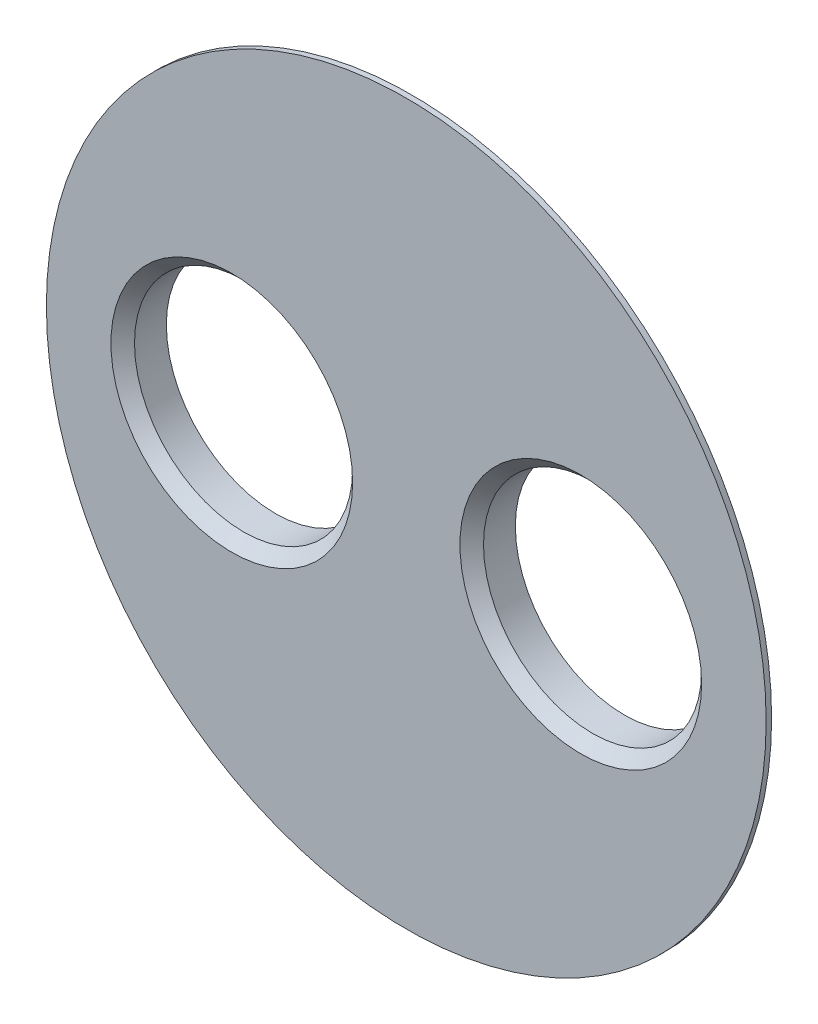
from build123d import *

# Parameters (mm, degrees)
ESQUISSE1_R             = 82.5
BOSS_EXTRU_1_DEPTH      = 10
ESQUISSE2_R             = 25
ENL_V_MAT_EXTRU_1_DEPTH = 10
CHANFREIN1_SIZE         = 2.7
CHANFREIN2_SIZE         = 12.5
CHANFREIN2_SIZE2        = 8.752594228


with BuildPart() as part:
    # Esquisse1 → Boss.-Extru.1 (new body)
    with BuildSketch(Plane.XY):
        Circle(ESQUISSE1_R)
    extrude(amount=BOSS_EXTRU_1_DEPTH)

    # Esquisse2 → Enl_v. mat.-Extru.1 (cut)
    with BuildSketch(Plane.XY.offset(10)):
        with Locations((-40, 0)):
            Circle(ESQUISSE2_R)
        with Locations((40, 0)):
            Circle(ESQUISSE2_R)
    extrude(amount=-ENL_V_MAT_EXTRU_1_DEPTH, mode=Mode.SUBTRACT)

    # Chanfrein1
    chanfrein1_edges = [part.edges().sort_by_distance(p)[0] for p in [
        (15, 0, 10),
        (-65, 0, 10),
    ]]
    chamfer(chanfrein1_edges, length=CHANFREIN1_SIZE)

    # Chanfrein2
    chanfrein2_edges = [part.edges().sort_by_distance(p)[0] for p in [
        (-82.5, 0, 0),
    ]]
    chanfrein2_side = [part.faces().sort_by_distance(p)[0] for p in [
        (0, 0, 0),
    ]]
    chamfer(chanfrein2_edges, length=CHANFREIN2_SIZE, length2=CHANFREIN2_SIZE2, reference=chanfrein2_side[0])


solid = part.part
